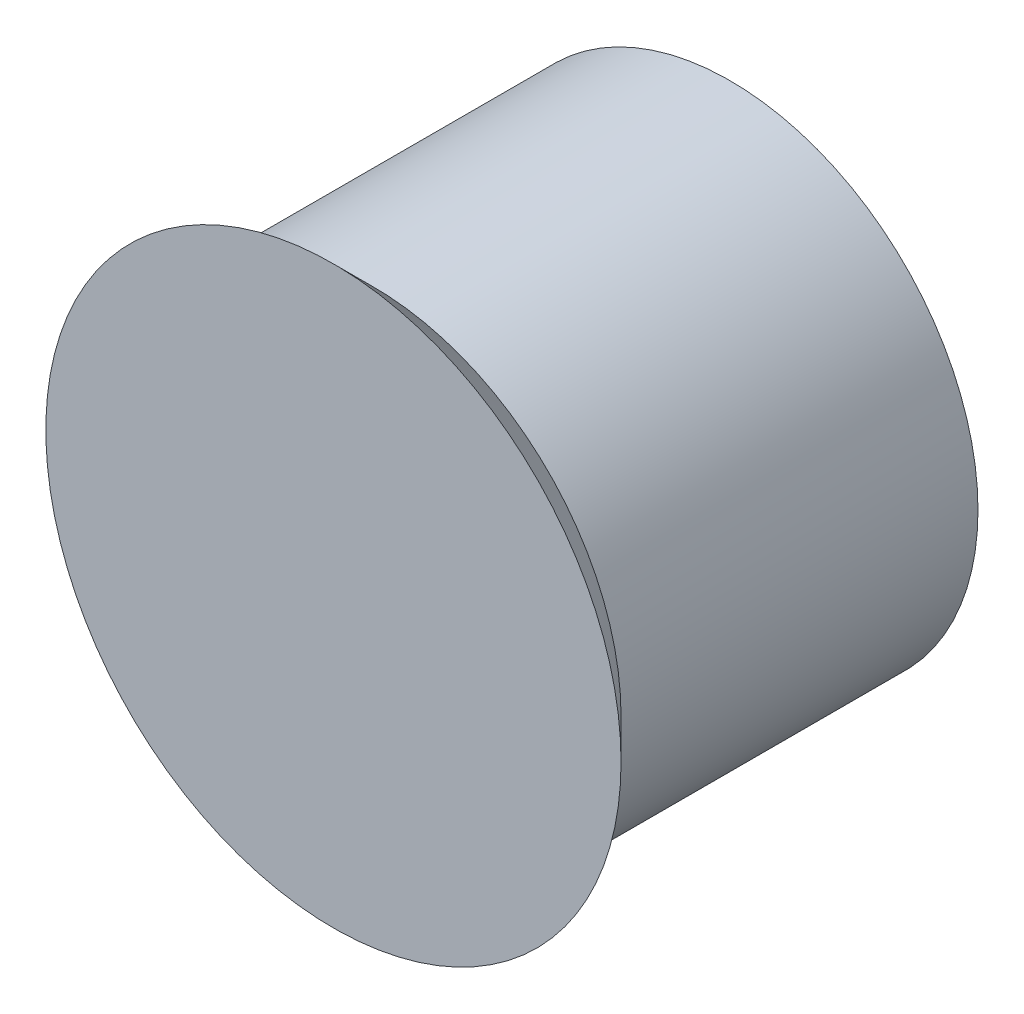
from build123d import *

# Parameters (mm, degrees)
IZIM1_R                     = 1.25
Y_KSEKLIK_EKSTR_ZYON1_DEPTH = 1.8
IZIM2_R                     = 1.250235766
Y_KSEKLIK_EKSTR_ZYON2_DEPTH = 0.2
Y_KSEKLIK_EKSTR_ZYON2_DRAFT = -45


with BuildPart() as part:
    # izim1 → Y_kseklik-Ekstr_zyon1 (new body)
    with BuildSketch(Plane.XY):
        Circle(IZIM1_R)
    extrude(amount=Y_KSEKLIK_EKSTR_ZYON1_DEPTH)


with BuildPart() as y_kseklik_ekstr_zyon2_tool:
    # izim2 → Y_kseklik-Ekstr_zyon2 (with draft: the straight prism first)
    with BuildSketch(Plane.XY.offset(1.8)):
        Circle(IZIM2_R)
    extrude(amount=Y_KSEKLIK_EKSTR_ZYON2_DEPTH)
    # Y_kseklik-Ekstr_zyon2: the draft: its side faces are tilted about the plane it starts from
    y_kseklik_ekstr_zyon2_sides = [y_kseklik_ekstr_zyon2_tool.faces().sort_by_distance(p)[0] for p in [
        (-1.250235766, 0, 1.9),
    ]]
    draft(y_kseklik_ekstr_zyon2_sides, Plane.XY.offset(1.8), Y_KSEKLIK_EKSTR_ZYON2_DRAFT)


with BuildPart() as part_1:
    add(part.part)

    # Y_kseklik-Ekstr_zyon2: add y_kseklik_ekstr_zyon2_tool
    add(y_kseklik_ekstr_zyon2_tool.part)


solid = part_1.part
